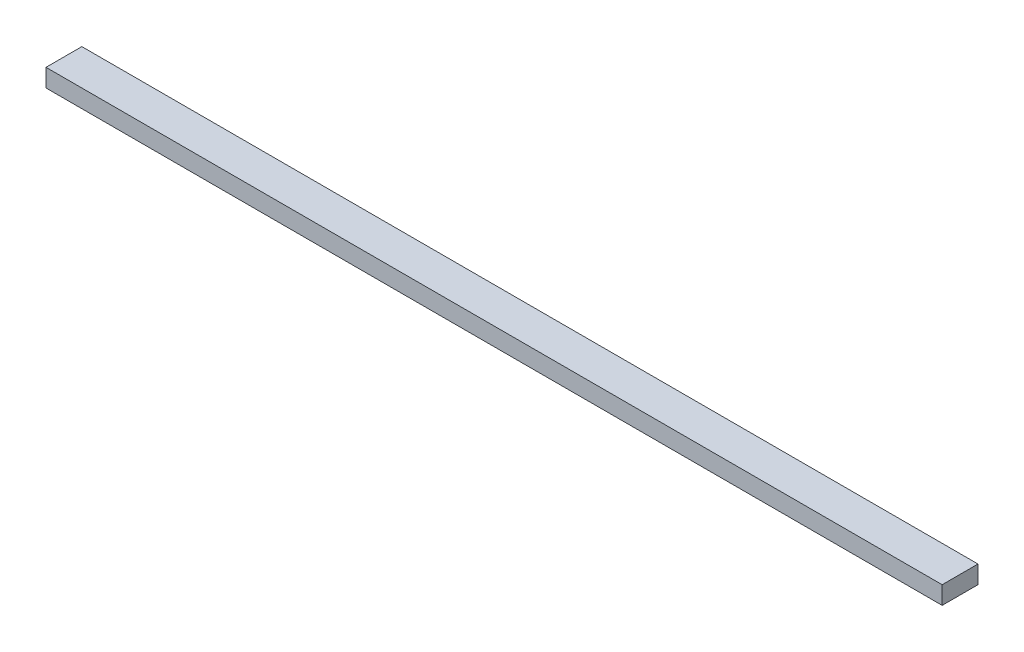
from build123d import *

# Parameters (mm, degrees)
ESQUISSE1_W      = 250
ESQUISSE1_H      = 10
EXTRUSION1_DEPTH = 5


with BuildPart() as part:
    # Esquisse1 → Extrusion1 (new body)
    with BuildSketch(Plane(origin=(0, 0, 0), x_dir=(1, 0, 0), z_dir=(0, 1, 0))):
        with Locations((125, 5)):
            Rectangle(ESQUISSE1_W, ESQUISSE1_H)
    extrude(amount=EXTRUSION1_DEPTH)


solid = part.part
